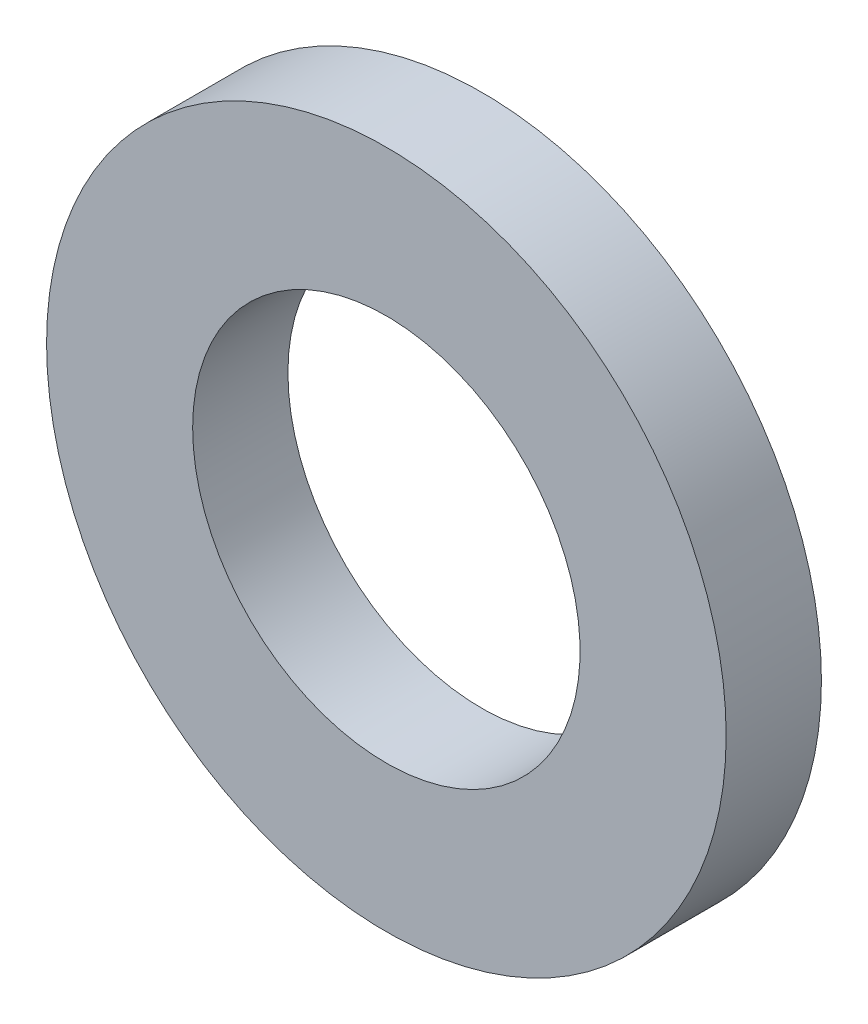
ISO-10303-21;
HEADER;
FILE_DESCRIPTION(('STEP AP214'),'2;1');
FILE_NAME('part.step','',(''),(''),'','','');
FILE_SCHEMA(('AUTOMOTIVE_DESIGN { 1 0 10303 214 1 1 1 1 }'));
ENDSEC;
DATA;
#1=APPLICATION_CONTEXT('core data for automotive mechanical design processes');
#2=APPLICATION_PROTOCOL_DEFINITION('international standard','automotive_design',2000,#1);
#3=PRODUCT_CONTEXT('',#1,'mechanical');
#4=PRODUCT('Part','Part','',(#3));
#5=PRODUCT_RELATED_PRODUCT_CATEGORY('part','',(#4));
#6=PRODUCT_DEFINITION_FORMATION('','',#4);
#7=PRODUCT_DEFINITION_CONTEXT('part definition',#1,'design');
#8=PRODUCT_DEFINITION('design','',#6,#7);
#9=PRODUCT_DEFINITION_SHAPE('','',#8);
#10=(LENGTH_UNIT() NAMED_UNIT(*) SI_UNIT(.MILLI.,.METRE.));
#11=(NAMED_UNIT(*) PLANE_ANGLE_UNIT() SI_UNIT($,.RADIAN.));
#12=(NAMED_UNIT(*) SI_UNIT($,.STERADIAN.) SOLID_ANGLE_UNIT());
#13=UNCERTAINTY_MEASURE_WITH_UNIT(LENGTH_MEASURE(1.E-05),#10,'distance_accuracy_value','');
#14=(GEOMETRIC_REPRESENTATION_CONTEXT(3) GLOBAL_UNCERTAINTY_ASSIGNED_CONTEXT((#13)) GLOBAL_UNIT_ASSIGNED_CONTEXT((#10,
#11,#12)) REPRESENTATION_CONTEXT('',''));
#15=CARTESIAN_POINT('',(0.,0.,0.));
#16=DIRECTION('',(0.,0.,1.));
#17=DIRECTION('',(1.,0.,0.));
#18=AXIS2_PLACEMENT_3D('',#15,#16,#17);
#19=CARTESIAN_POINT('',(0.,0.,1.49999999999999));
#20=DIRECTION('',(0.,0.,0.999999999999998));
#21=DIRECTION('',(0.999999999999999,0.,0.));
#22=AXIS2_PLACEMENT_3D('',#19,#20,#21);
#23=PLANE('',#22);
#24=CARTESIAN_POINT('',(0.,0.,1.49999999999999));
#25=DIRECTION('',(0.,0.,0.999999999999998));
#26=DIRECTION('',(0.999999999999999,0.,0.));
#27=AXIS2_PLACEMENT_3D('',#24,#25,#26);
#28=CIRCLE('',#27,5.35);
#29=CARTESIAN_POINT('',(-5.34999999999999,0.,1.49999999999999));
#30=VERTEX_POINT('',#29);
#31=EDGE_CURVE('E10',#30,#30,#28,.T.);
#32=ORIENTED_EDGE('',*,*,#31,.T.);
#33=EDGE_LOOP('',(#32));
#34=FACE_BOUND('',#33,.T.);
#35=CARTESIAN_POINT('',(0.,0.,1.49999999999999));
#36=DIRECTION('',(0.,0.,0.999999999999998));
#37=DIRECTION('',(0.999999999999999,0.,0.));
#38=AXIS2_PLACEMENT_3D('',#35,#36,#37);
#39=CIRCLE('',#38,3.05);
#40=CARTESIAN_POINT('',(-3.05,0.,1.49999999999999));
#41=VERTEX_POINT('',#40);
#42=EDGE_CURVE('E43',#41,#41,#39,.T.);
#43=ORIENTED_EDGE('',*,*,#42,.F.);
#44=EDGE_LOOP('',(#43));
#45=FACE_BOUND('',#44,.T.);
#46=ADVANCED_FACE('F32',(#34,#45),#23,.T.);
#47=CARTESIAN_POINT('',(0.,0.,0.));
#48=DIRECTION('',(0.,0.,0.999999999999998));
#49=DIRECTION('',(0.999999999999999,0.,0.));
#50=AXIS2_PLACEMENT_3D('',#47,#48,#49);
#51=PLANE('',#50);
#52=CARTESIAN_POINT('',(0.,0.,0.));
#53=DIRECTION('',(0.,0.,0.999999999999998));
#54=DIRECTION('',(0.999999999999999,0.,0.));
#55=AXIS2_PLACEMENT_3D('',#52,#53,#54);
#56=CIRCLE('',#55,5.35);
#57=CARTESIAN_POINT('',(-5.34999999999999,0.,0.));
#58=VERTEX_POINT('',#57);
#59=EDGE_CURVE('E39',#58,#58,#56,.T.);
#60=ORIENTED_EDGE('',*,*,#59,.F.);
#61=EDGE_LOOP('',(#60));
#62=FACE_BOUND('',#61,.T.);
#63=CARTESIAN_POINT('',(0.,0.,0.));
#64=DIRECTION('',(0.,0.,0.999999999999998));
#65=DIRECTION('',(0.999999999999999,0.,0.));
#66=AXIS2_PLACEMENT_3D('',#63,#64,#65);
#67=CIRCLE('',#66,3.05);
#68=CARTESIAN_POINT('',(-3.05,0.,0.));
#69=VERTEX_POINT('',#68);
#70=EDGE_CURVE('E47',#69,#69,#67,.T.);
#71=ORIENTED_EDGE('',*,*,#70,.T.);
#72=EDGE_LOOP('',(#71));
#73=FACE_BOUND('',#72,.T.);
#74=ADVANCED_FACE('F53',(#62,#73),#51,.F.);
#75=CARTESIAN_POINT('',(0.,0.,1.49999999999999));
#76=DIRECTION('',(0.,0.,-0.999999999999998));
#77=DIRECTION('',(-0.999999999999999,0.,0.));
#78=AXIS2_PLACEMENT_3D('',#75,#76,#77);
#79=CYLINDRICAL_SURFACE('',#78,5.35);
#80=CARTESIAN_POINT('',(-5.34999999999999,0.,1.49999999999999));
#81=CARTESIAN_POINT('',(-5.34999999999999,0.,1.48437499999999));
#82=CARTESIAN_POINT('',(-5.34999999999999,0.,1.46874999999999));
#83=CARTESIAN_POINT('',(-5.34999999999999,0.,1.43749999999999));
#84=CARTESIAN_POINT('',(-5.34999999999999,0.,1.42187499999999));
#85=CARTESIAN_POINT('',(-5.34999999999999,0.,1.39062499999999));
#86=CARTESIAN_POINT('',(-5.34999999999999,0.,1.37499999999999));
#87=CARTESIAN_POINT('',(-5.34999999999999,0.,1.34374999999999));
#88=CARTESIAN_POINT('',(-5.34999999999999,0.,1.32812499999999));
#89=CARTESIAN_POINT('',(-5.34999999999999,0.,1.29687499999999));
#90=CARTESIAN_POINT('',(-5.34999999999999,0.,1.28124999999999));
#91=CARTESIAN_POINT('',(-5.34999999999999,0.,1.24999999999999));
#92=CARTESIAN_POINT('',(-5.34999999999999,0.,1.23437499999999));
#93=CARTESIAN_POINT('',(-5.34999999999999,0.,1.20312499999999));
#94=CARTESIAN_POINT('',(-5.34999999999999,0.,1.18749999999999));
#95=CARTESIAN_POINT('',(-5.34999999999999,0.,1.15624999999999));
#96=CARTESIAN_POINT('',(-5.34999999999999,0.,1.14062499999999));
#97=CARTESIAN_POINT('',(-5.34999999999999,0.,1.10937499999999));
#98=CARTESIAN_POINT('',(-5.34999999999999,0.,1.09374999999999));
#99=CARTESIAN_POINT('',(-5.34999999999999,0.,1.06249999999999));
#100=CARTESIAN_POINT('',(-5.34999999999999,0.,1.04687499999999));
#101=CARTESIAN_POINT('',(-5.34999999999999,0.,1.01562499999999));
#102=CARTESIAN_POINT('',(-5.34999999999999,0.,0.999999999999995));
#103=CARTESIAN_POINT('',(-5.34999999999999,0.,0.968749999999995));
#104=CARTESIAN_POINT('',(-5.34999999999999,0.,0.953124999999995));
#105=CARTESIAN_POINT('',(-5.34999999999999,0.,0.921874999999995));
#106=CARTESIAN_POINT('',(-5.34999999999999,0.,0.906249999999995));
#107=CARTESIAN_POINT('',(-5.34999999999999,0.,0.874999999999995));
#108=CARTESIAN_POINT('',(-5.34999999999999,0.,0.859374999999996));
#109=CARTESIAN_POINT('',(-5.34999999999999,0.,0.828124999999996));
#110=CARTESIAN_POINT('',(-5.34999999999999,0.,0.812499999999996));
#111=CARTESIAN_POINT('',(-5.34999999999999,0.,0.781249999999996));
#112=CARTESIAN_POINT('',(-5.34999999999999,0.,0.765624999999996));
#113=CARTESIAN_POINT('',(-5.34999999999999,0.,0.734374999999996));
#114=CARTESIAN_POINT('',(-5.34999999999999,0.,0.718749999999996));
#115=CARTESIAN_POINT('',(-5.34999999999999,0.,0.687499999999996));
#116=CARTESIAN_POINT('',(-5.34999999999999,0.,0.671874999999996));
#117=CARTESIAN_POINT('',(-5.34999999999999,0.,0.640624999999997));
#118=CARTESIAN_POINT('',(-5.34999999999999,0.,0.624999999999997));
#119=CARTESIAN_POINT('',(-5.34999999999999,0.,0.593749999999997));
#120=CARTESIAN_POINT('',(-5.34999999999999,0.,0.578124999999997));
#121=CARTESIAN_POINT('',(-5.34999999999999,0.,0.546874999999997));
#122=CARTESIAN_POINT('',(-5.34999999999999,0.,0.531249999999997));
#123=CARTESIAN_POINT('',(-5.34999999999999,0.,0.499999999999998));
#124=CARTESIAN_POINT('',(-5.34999999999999,0.,0.484374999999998));
#125=CARTESIAN_POINT('',(-5.34999999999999,0.,0.453124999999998));
#126=CARTESIAN_POINT('',(-5.34999999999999,0.,0.437499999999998));
#127=CARTESIAN_POINT('',(-5.34999999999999,0.,0.406249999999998));
#128=CARTESIAN_POINT('',(-5.34999999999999,0.,0.390624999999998));
#129=CARTESIAN_POINT('',(-5.34999999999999,0.,0.359374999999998));
#130=CARTESIAN_POINT('',(-5.34999999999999,0.,0.343749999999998));
#131=CARTESIAN_POINT('',(-5.34999999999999,0.,0.312499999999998));
#132=CARTESIAN_POINT('',(-5.34999999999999,0.,0.296874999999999));
#133=CARTESIAN_POINT('',(-5.34999999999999,0.,0.265624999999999));
#134=CARTESIAN_POINT('',(-5.34999999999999,0.,0.249999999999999));
#135=CARTESIAN_POINT('',(-5.34999999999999,0.,0.218749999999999));
#136=CARTESIAN_POINT('',(-5.34999999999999,0.,0.203124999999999));
#137=CARTESIAN_POINT('',(-5.34999999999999,0.,0.171874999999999));
#138=CARTESIAN_POINT('',(-5.34999999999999,0.,0.156249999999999));
#139=CARTESIAN_POINT('',(-5.34999999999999,0.,0.124999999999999));
#140=CARTESIAN_POINT('',(-5.34999999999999,0.,0.109374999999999));
#141=CARTESIAN_POINT('',(-5.34999999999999,0.,0.0781249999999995));
#142=CARTESIAN_POINT('',(-5.34999999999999,0.,0.0624999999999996));
#143=CARTESIAN_POINT('',(-5.34999999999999,0.,0.0312499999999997));
#144=CARTESIAN_POINT('',(-5.34999999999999,0.,0.0156249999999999));
#145=CARTESIAN_POINT('',(-5.34999999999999,0.,0.));
#146=B_SPLINE_CURVE_WITH_KNOTS('',3,(#80,#81,#82,#83,#84,#85,#86,#87,#88,#89,#90,#91,#92,#93,
#94,#95,#96,#97,#98,#99,#100,#101,#102,#103,#104,#105,#106,#107,#108,#109,#110,#111,#112,#113,
#114,#115,#116,#117,#118,#119,#120,#121,#122,#123,#124,#125,#126,#127,#128,#129,#130,#131,#132,
#133,#134,#135,#136,#137,#138,#139,#140,#141,#142,#143,#144,#145),.UNSPECIFIED.,.F.,.F.,(4,2,2,
2,2,2,2,2,2,2,2,2,2,2,2,2,2,2,2,2,2,2,2,2,2,2,2,2,2,2,2,2,4),(0.,0.0468749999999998,
0.0937499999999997,0.140624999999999,0.187499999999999,0.234374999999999,0.281249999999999,
0.328124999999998,0.374999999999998,0.421874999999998,0.468749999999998,0.515624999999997,
0.562499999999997,0.609374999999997,0.656249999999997,0.703124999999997,0.749999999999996,
0.796874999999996,0.843749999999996,0.890624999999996,0.937499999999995,0.984374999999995,
1.03124999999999,1.07812499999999,1.12499999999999,1.17187499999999,1.21874999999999,
1.26562499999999,1.31249999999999,1.35937499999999,1.40624999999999,1.45312499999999,
1.49999999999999),.UNSPECIFIED.);
#147=EDGE_CURVE('BSEAM34',#30,#58,#146,.T.);
#148=ORIENTED_EDGE('',*,*,#31,.F.);
#149=ORIENTED_EDGE('',*,*,#59,.T.);
#150=ORIENTED_EDGE('',*,*,#147,.T.);
#151=ORIENTED_EDGE('',*,*,#147,.F.);
#152=EDGE_LOOP('',(#148,#150,#149,#151));
#153=FACE_BOUND('',#152,.T.);
#154=ADVANCED_FACE('F34',(#153),#79,.T.);
#155=CARTESIAN_POINT('',(0.,0.,1.49999999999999));
#156=DIRECTION('',(0.,0.,-0.999999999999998));
#157=DIRECTION('',(-0.999999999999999,0.,0.));
#158=AXIS2_PLACEMENT_3D('',#155,#156,#157);
#159=CYLINDRICAL_SURFACE('',#158,3.05);
#160=CARTESIAN_POINT('',(-3.05,0.,1.49999999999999));
#161=CARTESIAN_POINT('',(-3.05,0.,1.48437499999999));
#162=CARTESIAN_POINT('',(-3.05,0.,1.46874999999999));
#163=CARTESIAN_POINT('',(-3.05,0.,1.43749999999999));
#164=CARTESIAN_POINT('',(-3.05,0.,1.42187499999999));
#165=CARTESIAN_POINT('',(-3.05,0.,1.39062499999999));
#166=CARTESIAN_POINT('',(-3.05,0.,1.37499999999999));
#167=CARTESIAN_POINT('',(-3.05,0.,1.34374999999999));
#168=CARTESIAN_POINT('',(-3.05,0.,1.32812499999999));
#169=CARTESIAN_POINT('',(-3.05,0.,1.29687499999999));
#170=CARTESIAN_POINT('',(-3.05,0.,1.28124999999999));
#171=CARTESIAN_POINT('',(-3.05,0.,1.24999999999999));
#172=CARTESIAN_POINT('',(-3.05,0.,1.23437499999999));
#173=CARTESIAN_POINT('',(-3.05,0.,1.20312499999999));
#174=CARTESIAN_POINT('',(-3.05,0.,1.18749999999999));
#175=CARTESIAN_POINT('',(-3.05,0.,1.15624999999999));
#176=CARTESIAN_POINT('',(-3.05,0.,1.14062499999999));
#177=CARTESIAN_POINT('',(-3.05,0.,1.10937499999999));
#178=CARTESIAN_POINT('',(-3.05,0.,1.09374999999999));
#179=CARTESIAN_POINT('',(-3.05,0.,1.06249999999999));
#180=CARTESIAN_POINT('',(-3.05,0.,1.04687499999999));
#181=CARTESIAN_POINT('',(-3.05,0.,1.01562499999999));
#182=CARTESIAN_POINT('',(-3.05,0.,0.999999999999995));
#183=CARTESIAN_POINT('',(-3.05,0.,0.968749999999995));
#184=CARTESIAN_POINT('',(-3.05,0.,0.953124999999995));
#185=CARTESIAN_POINT('',(-3.05,0.,0.921874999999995));
#186=CARTESIAN_POINT('',(-3.05,0.,0.906249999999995));
#187=CARTESIAN_POINT('',(-3.05,0.,0.874999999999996));
#188=CARTESIAN_POINT('',(-3.05,0.,0.859374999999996));
#189=CARTESIAN_POINT('',(-3.05,0.,0.828124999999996));
#190=CARTESIAN_POINT('',(-3.05,0.,0.812499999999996));
#191=CARTESIAN_POINT('',(-3.05,0.,0.781249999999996));
#192=CARTESIAN_POINT('',(-3.05,0.,0.765624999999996));
#193=CARTESIAN_POINT('',(-3.05,0.,0.734374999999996));
#194=CARTESIAN_POINT('',(-3.05,0.,0.718749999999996));
#195=CARTESIAN_POINT('',(-3.05,0.,0.687499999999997));
#196=CARTESIAN_POINT('',(-3.05,0.,0.671874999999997));
#197=CARTESIAN_POINT('',(-3.05,0.,0.640624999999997));
#198=CARTESIAN_POINT('',(-3.05,0.,0.624999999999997));
#199=CARTESIAN_POINT('',(-3.05,0.,0.593749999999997));
#200=CARTESIAN_POINT('',(-3.05,0.,0.578124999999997));
#201=CARTESIAN_POINT('',(-3.05,0.,0.546874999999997));
#202=CARTESIAN_POINT('',(-3.05,0.,0.531249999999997));
#203=CARTESIAN_POINT('',(-3.05,0.,0.499999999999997));
#204=CARTESIAN_POINT('',(-3.05,0.,0.484374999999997));
#205=CARTESIAN_POINT('',(-3.05,0.,0.453124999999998));
#206=CARTESIAN_POINT('',(-3.05,0.,0.437499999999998));
#207=CARTESIAN_POINT('',(-3.05,0.,0.406249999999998));
#208=CARTESIAN_POINT('',(-3.05,0.,0.390624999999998));
#209=CARTESIAN_POINT('',(-3.05,0.,0.359374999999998));
#210=CARTESIAN_POINT('',(-3.05,0.,0.343749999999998));
#211=CARTESIAN_POINT('',(-3.05,0.,0.312499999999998));
#212=CARTESIAN_POINT('',(-3.05,0.,0.296874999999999));
#213=CARTESIAN_POINT('',(-3.05,0.,0.265624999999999));
#214=CARTESIAN_POINT('',(-3.05,0.,0.249999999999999));
#215=CARTESIAN_POINT('',(-3.05,0.,0.218749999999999));
#216=CARTESIAN_POINT('',(-3.05,0.,0.203124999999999));
#217=CARTESIAN_POINT('',(-3.05,0.,0.171874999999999));
#218=CARTESIAN_POINT('',(-3.05,0.,0.156249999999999));
#219=CARTESIAN_POINT('',(-3.05,0.,0.124999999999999));
#220=CARTESIAN_POINT('',(-3.05,0.,0.109374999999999));
#221=CARTESIAN_POINT('',(-3.05,0.,0.0781249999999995));
#222=CARTESIAN_POINT('',(-3.05,0.,0.0624999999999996));
#223=CARTESIAN_POINT('',(-3.05,0.,0.0312499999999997));
#224=CARTESIAN_POINT('',(-3.05,0.,0.0156249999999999));
#225=CARTESIAN_POINT('',(-3.05,0.,0.));
#226=B_SPLINE_CURVE_WITH_KNOTS('',3,(#160,#161,#162,#163,#164,#165,#166,#167,#168,#169,#170,
#171,#172,#173,#174,#175,#176,#177,#178,#179,#180,#181,#182,#183,#184,#185,#186,#187,#188,#189,
#190,#191,#192,#193,#194,#195,#196,#197,#198,#199,#200,#201,#202,#203,#204,#205,#206,#207,#208,
#209,#210,#211,#212,#213,#214,#215,#216,#217,#218,#219,#220,#221,#222,#223,#224,#225),
.UNSPECIFIED.,.F.,.F.,(4,2,2,2,2,2,2,2,2,2,2,2,2,2,2,2,2,2,2,2,2,2,2,2,2,2,2,2,2,2,2,2,4),(0.,
0.0468749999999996,0.0937499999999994,0.140624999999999,0.187499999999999,0.234374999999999,
0.281249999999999,0.328124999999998,0.374999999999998,0.421874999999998,0.468749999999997,
0.515624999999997,0.562499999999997,0.609374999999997,0.656249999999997,0.703124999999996,
0.749999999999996,0.796874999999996,0.843749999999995,0.890624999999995,0.937499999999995,
0.984374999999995,1.03124999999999,1.07812499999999,1.12499999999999,1.17187499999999,
1.21874999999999,1.26562499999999,1.31249999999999,1.35937499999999,1.40624999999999,
1.45312499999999,1.49999999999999),.UNSPECIFIED.);
#227=EDGE_CURVE('BSEAM55',#41,#69,#226,.T.);
#228=ORIENTED_EDGE('',*,*,#42,.T.);
#229=ORIENTED_EDGE('',*,*,#70,.F.);
#230=ORIENTED_EDGE('',*,*,#227,.T.);
#231=ORIENTED_EDGE('',*,*,#227,.F.);
#232=EDGE_LOOP('',(#228,#230,#229,#231));
#233=FACE_BOUND('',#232,.T.);
#234=ADVANCED_FACE('F55',(#233),#159,.F.);
#235=CLOSED_SHELL('',(#46,#74,#154,#234));
#236=MANIFOLD_SOLID_BREP('B2',#235);
#237=ADVANCED_BREP_SHAPE_REPRESENTATION('',(#18,#236),#14);
#238=SHAPE_DEFINITION_REPRESENTATION(#9,#237);
ENDSEC;
END-ISO-10303-21;
